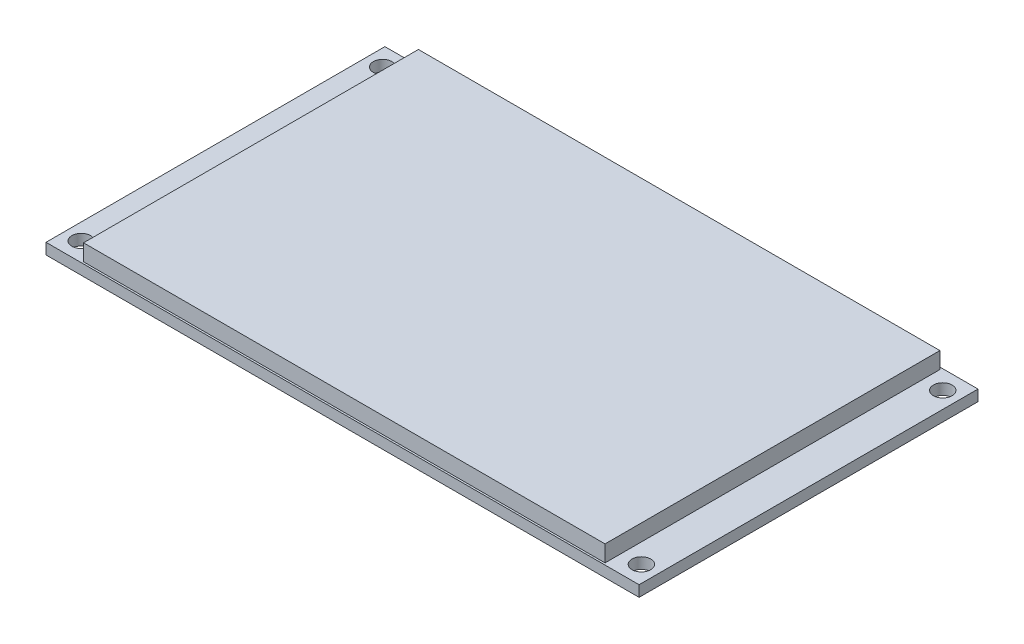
from build123d import *

# Parameters (mm, degrees)
SCHIZZO2_W                   = 108.04
SCHIZZO2_H                   = 61.74
ESTRUSIONE_ESTRUSIONE1_DEPTH = 2
SCHIZZO3_W                   = 95
SCHIZZO3_H                   = 61
ESTRUSIONE_ESTRUSIONE2_DEPTH = 3
FORO_PER_VITE_M3_2_D         = 3.4


with BuildPart() as part:
    # Schizzo2 → Estrusione-Estrusione1 (new body)
    with BuildSketch(Plane(origin=(0, 0, 0), x_dir=(1, 0, 0), z_dir=(0, 1, 0))):
        Rectangle(SCHIZZO2_W, SCHIZZO2_H)
    extrude(amount=ESTRUSIONE_ESTRUSIONE1_DEPTH)

    # Schizzo3 → Estrusione-Estrusione2 (add)
    with BuildSketch(Plane(origin=(0, 2, 0), x_dir=(1, 0, 0), z_dir=(0, 1, 0))):
        with Locations((-0.02, -0.03)):
            Rectangle(SCHIZZO3_W, SCHIZZO3_H)
    extrude(amount=ESTRUSIONE_ESTRUSIONE2_DEPTH)

    # Foro per Vite M3-2 (through all)
    with Locations(Plane(origin=(0, 2, 0), x_dir=(1, 0, 0), z_dir=(0, 1, 0))):
        with Locations((-51.02, 27.45), (-51.02, -27.45), (51.02, 27.45), (51.02, -27.45)):
            Hole(FORO_PER_VITE_M3_2_D / 2)


solid = part.part
